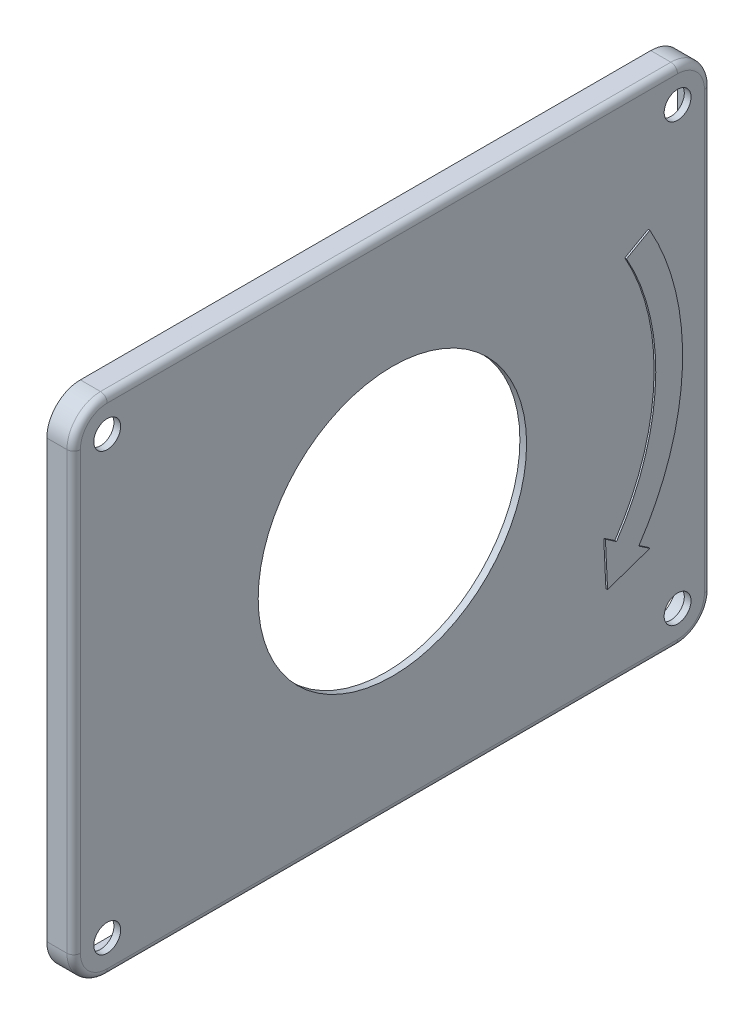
ISO-10303-21;
HEADER;
FILE_DESCRIPTION(('STEP AP214'),'2;1');
FILE_NAME('part.step','',(''),(''),'','','');
FILE_SCHEMA(('AUTOMOTIVE_DESIGN { 1 0 10303 214 1 1 1 1 }'));
ENDSEC;
DATA;
#1=APPLICATION_CONTEXT('core data for automotive mechanical design processes');
#2=APPLICATION_PROTOCOL_DEFINITION('international standard','automotive_design',2000,#1);
#3=PRODUCT_CONTEXT('',#1,'mechanical');
#4=PRODUCT('Part','Part','',(#3));
#5=PRODUCT_RELATED_PRODUCT_CATEGORY('part','',(#4));
#6=PRODUCT_DEFINITION_FORMATION('','',#4);
#7=PRODUCT_DEFINITION_CONTEXT('part definition',#1,'design');
#8=PRODUCT_DEFINITION('design','',#6,#7);
#9=PRODUCT_DEFINITION_SHAPE('','',#8);
#10=(LENGTH_UNIT() NAMED_UNIT(*) SI_UNIT(.MILLI.,.METRE.));
#11=(NAMED_UNIT(*) PLANE_ANGLE_UNIT() SI_UNIT($,.RADIAN.));
#12=(NAMED_UNIT(*) SI_UNIT($,.STERADIAN.) SOLID_ANGLE_UNIT());
#13=UNCERTAINTY_MEASURE_WITH_UNIT(LENGTH_MEASURE(1.E-05),#10,'distance_accuracy_value','');
#14=(GEOMETRIC_REPRESENTATION_CONTEXT(3) GLOBAL_UNCERTAINTY_ASSIGNED_CONTEXT((#13)) GLOBAL_UNIT_ASSIGNED_CONTEXT((#10,
#11,#12)) REPRESENTATION_CONTEXT('',''));
#15=CARTESIAN_POINT('',(0.,0.,0.));
#16=DIRECTION('',(0.,0.,1.));
#17=DIRECTION('',(1.,0.,0.));
#18=AXIS2_PLACEMENT_3D('',#15,#16,#17);
#19=CARTESIAN_POINT('',(2.,-32.5,42.5));
#20=DIRECTION('',(1.,0.,0.));
#21=DIRECTION('',(0.,0.,1.));
#22=AXIS2_PLACEMENT_3D('',#19,#20,#21);
#23=PLANE('',#22);
#24=DIRECTION('',(0.,1.,0.));
#25=VECTOR('',#24,1.);
#26=CARTESIAN_POINT('',(2.,32.5,46.5));
#27=LINE('',#26,#25);
#28=CARTESIAN_POINT('',(2.,-32.5,46.5));
#29=VERTEX_POINT('',#28);
#30=CARTESIAN_POINT('',(2.,32.5,46.5));
#31=VERTEX_POINT('',#30);
#32=EDGE_CURVE('E419',#29,#31,#27,.T.);
#33=ORIENTED_EDGE('',*,*,#32,.F.);
#34=CARTESIAN_POINT('',(2.,-32.5,42.5));
#35=DIRECTION('',(-1.,0.,0.));
#36=DIRECTION('',(0.,0.,1.));
#37=AXIS2_PLACEMENT_3D('',#34,#35,#36);
#38=CIRCLE('',#37,3.99999999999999);
#39=CARTESIAN_POINT('',(2.,-36.5,42.5));
#40=VERTEX_POINT('',#39);
#41=EDGE_CURVE('E416',#40,#29,#38,.T.);
#42=ORIENTED_EDGE('',*,*,#41,.F.);
#43=DIRECTION('',(0.,0.,1.));
#44=VECTOR('',#43,1.);
#45=CARTESIAN_POINT('',(2.,-36.5,42.5));
#46=LINE('',#45,#44);
#47=CARTESIAN_POINT('',(2.,-36.5,-42.5));
#48=VERTEX_POINT('',#47);
#49=EDGE_CURVE('E413',#48,#40,#46,.T.);
#50=ORIENTED_EDGE('',*,*,#49,.F.);
#51=CARTESIAN_POINT('',(2.,-32.5,-42.5));
#52=DIRECTION('',(-1.,0.,0.));
#53=DIRECTION('',(0.,0.,1.));
#54=AXIS2_PLACEMENT_3D('',#51,#52,#53);
#55=CIRCLE('',#54,4.);
#56=CARTESIAN_POINT('',(2.,-32.5,-46.5));
#57=VERTEX_POINT('',#56);
#58=EDGE_CURVE('E410',#57,#48,#55,.T.);
#59=ORIENTED_EDGE('',*,*,#58,.F.);
#60=DIRECTION('',(0.,-1.,0.));
#61=VECTOR('',#60,1.);
#62=CARTESIAN_POINT('',(2.,-32.5,-46.5));
#63=LINE('',#62,#61);
#64=CARTESIAN_POINT('',(2.,32.5,-46.5));
#65=VERTEX_POINT('',#64);
#66=EDGE_CURVE('E407',#65,#57,#63,.T.);
#67=ORIENTED_EDGE('',*,*,#66,.F.);
#68=CARTESIAN_POINT('',(2.,32.5,-42.5));
#69=DIRECTION('',(-1.,0.,0.));
#70=DIRECTION('',(0.,0.,1.));
#71=AXIS2_PLACEMENT_3D('',#68,#69,#70);
#72=CIRCLE('',#71,4.);
#73=CARTESIAN_POINT('',(2.,36.5,-42.5));
#74=VERTEX_POINT('',#73);
#75=EDGE_CURVE('E404',#74,#65,#72,.T.);
#76=ORIENTED_EDGE('',*,*,#75,.F.);
#77=DIRECTION('',(0.,0.,-1.));
#78=VECTOR('',#77,1.);
#79=CARTESIAN_POINT('',(2.,36.5,-42.5));
#80=LINE('',#79,#78);
#81=CARTESIAN_POINT('',(2.,36.5,42.5));
#82=VERTEX_POINT('',#81);
#83=EDGE_CURVE('E401',#82,#74,#80,.T.);
#84=ORIENTED_EDGE('',*,*,#83,.F.);
#85=CARTESIAN_POINT('',(2.,32.5,42.5));
#86=DIRECTION('',(-1.,0.,0.));
#87=DIRECTION('',(0.,0.,1.));
#88=AXIS2_PLACEMENT_3D('',#85,#86,#87);
#89=CIRCLE('',#88,4.);
#90=EDGE_CURVE('E422',#31,#82,#89,.T.);
#91=ORIENTED_EDGE('',*,*,#90,.F.);
#92=EDGE_LOOP('',(#33,#42,#50,#59,#67,#76,#84,#91));
#93=FACE_BOUND('',#92,.T.);
#94=CARTESIAN_POINT('',(2.,32.5,42.5));
#95=DIRECTION('',(-1.,0.,0.));
#96=DIRECTION('',(0.,0.,1.));
#97=AXIS2_PLACEMENT_3D('',#94,#95,#96);
#98=CIRCLE('',#97,2.);
#99=CARTESIAN_POINT('',(2.,32.5,44.5));
#100=VERTEX_POINT('',#99);
#101=EDGE_CURVE('E348',#100,#100,#98,.T.);
#102=ORIENTED_EDGE('',*,*,#101,.T.);
#103=EDGE_LOOP('',(#102));
#104=FACE_BOUND('',#103,.T.);
#105=CARTESIAN_POINT('',(2.,-32.5,-42.5));
#106=DIRECTION('',(-1.,0.,0.));
#107=DIRECTION('',(0.,0.,1.));
#108=AXIS2_PLACEMENT_3D('',#105,#106,#107);
#109=CIRCLE('',#108,2.);
#110=CARTESIAN_POINT('',(2.,-32.5,-40.5));
#111=VERTEX_POINT('',#110);
#112=EDGE_CURVE('E355',#111,#111,#109,.T.);
#113=ORIENTED_EDGE('',*,*,#112,.T.);
#114=EDGE_LOOP('',(#113));
#115=FACE_BOUND('',#114,.T.);
#116=CARTESIAN_POINT('',(2.,32.5,-42.5));
#117=DIRECTION('',(-1.,0.,0.));
#118=DIRECTION('',(0.,0.,1.));
#119=AXIS2_PLACEMENT_3D('',#116,#117,#118);
#120=CIRCLE('',#119,2.);
#121=CARTESIAN_POINT('',(2.,32.5,-40.5));
#122=VERTEX_POINT('',#121);
#123=EDGE_CURVE('E358',#122,#122,#120,.T.);
#124=ORIENTED_EDGE('',*,*,#123,.T.);
#125=EDGE_LOOP('',(#124));
#126=FACE_BOUND('',#125,.T.);
#127=CARTESIAN_POINT('',(2.,-32.5,42.5));
#128=DIRECTION('',(-1.,0.,0.));
#129=DIRECTION('',(0.,0.,1.));
#130=AXIS2_PLACEMENT_3D('',#127,#128,#129);
#131=CIRCLE('',#130,2.);
#132=CARTESIAN_POINT('',(2.,-32.5,44.5));
#133=VERTEX_POINT('',#132);
#134=EDGE_CURVE('E352',#133,#133,#131,.T.);
#135=ORIENTED_EDGE('',*,*,#134,.T.);
#136=EDGE_LOOP('',(#135));
#137=FACE_BOUND('',#136,.T.);
#138=CARTESIAN_POINT('',(2.,0.,0.));
#139=DIRECTION('',(-1.,0.,0.));
#140=DIRECTION('',(0.,0.,1.));
#141=AXIS2_PLACEMENT_3D('',#138,#139,#140);
#142=CIRCLE('',#141,20.);
#143=CARTESIAN_POINT('',(2.,0.,20.));
#144=VERTEX_POINT('',#143);
#145=EDGE_CURVE('E345',#144,#144,#142,.T.);
#146=ORIENTED_EDGE('',*,*,#145,.T.);
#147=EDGE_LOOP('',(#146));
#148=FACE_BOUND('',#147,.T.);
#149=DIRECTION('',(0.,0.490258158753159,-0.871577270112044));
#150=VECTOR('',#149,1.);
#151=CARTESIAN_POINT('',(2.,16.6687773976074,-34.6336271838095));
#152=LINE('',#151,#150);
#153=CARTESIAN_POINT('',(2.,16.6687773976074,-34.6336271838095));
#154=VERTEX_POINT('',#153);
#155=CARTESIAN_POINT('',(2.,18.62981003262,-38.1199362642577));
#156=VERTEX_POINT('',#155);
#157=EDGE_CURVE('E236',#154,#156,#152,.T.);
#158=ORIENTED_EDGE('',*,*,#157,.T.);
#159=CARTESIAN_POINT('',(2.,0.,-5.));
#160=DIRECTION('',(-1.,0.,0.));
#161=DIRECTION('',(0.,0.,1.));
#162=AXIS2_PLACEMENT_3D('',#159,#160,#161);
#163=CIRCLE('',#162,38.);
#164=CARTESIAN_POINT('',(2.,-21.3077571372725,-36.4639394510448));
#165=VERTEX_POINT('',#164);
#166=EDGE_CURVE('E265',#156,#165,#163,.T.);
#167=ORIENTED_EDGE('',*,*,#166,.T.);
#168=DIRECTION('',(0.,-0.560730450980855,-0.827998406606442));
#169=VECTOR('',#168,1.);
#170=CARTESIAN_POINT('',(2.,-21.3077571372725,-36.4639394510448));
#171=LINE('',#170,#169);
#172=CARTESIAN_POINT('',(2.,-22.4292180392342,-38.1199362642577));
#173=VERTEX_POINT('',#172);
#174=EDGE_CURVE('E268',#165,#173,#171,.T.);
#175=ORIENTED_EDGE('',*,*,#174,.T.);
#176=DIRECTION('',(0.,-0.325666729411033,0.945484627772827));
#177=VECTOR('',#176,1.);
#178=CARTESIAN_POINT('',(2.,-22.4292180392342,-38.1199362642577));
#179=LINE('',#178,#177);
#180=CARTESIAN_POINT('',(2.,-24.5994306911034,-31.8193150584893));
#181=VERTEX_POINT('',#180);
#182=EDGE_CURVE('E271',#173,#181,#179,.T.);
#183=ORIENTED_EDGE('',*,*,#182,.T.);
#184=DIRECTION('',(0.,0.99882196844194,0.0485249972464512));
#185=VECTOR('',#184,1.);
#186=CARTESIAN_POINT('',(2.,-17.9433744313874,-31.4959490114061));
#187=LINE('',#186,#185);
#188=CARTESIAN_POINT('',(2.,-17.9433744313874,-31.4959490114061));
#189=VERTEX_POINT('',#188);
#190=EDGE_CURVE('E248',#181,#189,#187,.T.);
#191=ORIENTED_EDGE('',*,*,#190,.T.);
#192=DIRECTION('',(0.,-0.560730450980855,-0.827998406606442));
#193=VECTOR('',#192,1.);
#194=CARTESIAN_POINT('',(2.,-19.0648353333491,-33.151945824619));
#195=LINE('',#194,#193);
#196=CARTESIAN_POINT('',(2.,-19.0648353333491,-33.151945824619));
#197=VERTEX_POINT('',#196);
#198=EDGE_CURVE('E245',#189,#197,#195,.T.);
#199=ORIENTED_EDGE('',*,*,#198,.T.);
#200=CARTESIAN_POINT('',(2.,0.,-5.));
#201=DIRECTION('',(1.,0.,0.));
#202=DIRECTION('',(0.,0.,1.));
#203=AXIS2_PLACEMENT_3D('',#200,#201,#202);
#204=CIRCLE('',#203,34.);
#205=EDGE_CURVE('E262',#197,#154,#204,.T.);
#206=ORIENTED_EDGE('',*,*,#205,.T.);
#207=EDGE_LOOP('',(#158,#167,#175,#183,#191,#199,#206));
#208=FACE_BOUND('',#207,.T.);
#209=ADVANCED_FACE('F39',(#93,#104,#115,#126,#137,#148,#208),#23,.T.);
#210=CARTESIAN_POINT('',(1.,-32.5,42.5));
#211=DIRECTION('',(1.,0.,0.));
#212=DIRECTION('',(0.,0.,1.));
#213=AXIS2_PLACEMENT_3D('',#210,#211,#212);
#214=PLANE('',#213);
#215=CARTESIAN_POINT('',(1.,-32.5,42.5));
#216=DIRECTION('',(-1.,0.,0.));
#217=DIRECTION('',(0.,0.,1.));
#218=AXIS2_PLACEMENT_3D('',#215,#216,#217);
#219=CIRCLE('',#218,2.);
#220=CARTESIAN_POINT('',(1.,-32.5,44.5));
#221=VERTEX_POINT('',#220);
#222=EDGE_CURVE('E47',#221,#221,#219,.T.);
#223=ORIENTED_EDGE('',*,*,#222,.F.);
#224=EDGE_LOOP('',(#223));
#225=FACE_BOUND('',#224,.T.);
#226=CARTESIAN_POINT('',(1.,32.5,-42.5));
#227=DIRECTION('',(-1.,0.,0.));
#228=DIRECTION('',(0.,0.,1.));
#229=AXIS2_PLACEMENT_3D('',#226,#227,#228);
#230=CIRCLE('',#229,2.);
#231=CARTESIAN_POINT('',(1.,32.5,-40.5));
#232=VERTEX_POINT('',#231);
#233=EDGE_CURVE('E466',#232,#232,#230,.T.);
#234=ORIENTED_EDGE('',*,*,#233,.F.);
#235=EDGE_LOOP('',(#234));
#236=FACE_BOUND('',#235,.T.);
#237=DIRECTION('',(0.,-1.,0.));
#238=VECTOR('',#237,1.);
#239=CARTESIAN_POINT('',(1.,-32.5,46.5));
#240=LINE('',#239,#238);
#241=CARTESIAN_POINT('',(1.,32.5,46.5));
#242=VERTEX_POINT('',#241);
#243=CARTESIAN_POINT('',(1.,-32.5,46.5));
#244=VERTEX_POINT('',#243);
#245=EDGE_CURVE('E285',#242,#244,#240,.T.);
#246=ORIENTED_EDGE('',*,*,#245,.F.);
#247=CARTESIAN_POINT('',(1.,32.5,42.5));
#248=DIRECTION('',(-1.,0.,0.));
#249=DIRECTION('',(0.,0.,1.));
#250=AXIS2_PLACEMENT_3D('',#247,#248,#249);
#251=CIRCLE('',#250,4.);
#252=CARTESIAN_POINT('',(1.,36.5,42.5));
#253=VERTEX_POINT('',#252);
#254=EDGE_CURVE('E289',#253,#242,#251,.F.);
#255=ORIENTED_EDGE('',*,*,#254,.F.);
#256=DIRECTION('',(0.,0.,-1.));
#257=VECTOR('',#256,1.);
#258=CARTESIAN_POINT('',(1.,36.5,-42.5));
#259=LINE('',#258,#257);
#260=CARTESIAN_POINT('',(1.,36.5,-42.5));
#261=VERTEX_POINT('',#260);
#262=EDGE_CURVE('E292',#253,#261,#259,.T.);
#263=ORIENTED_EDGE('',*,*,#262,.T.);
#264=CARTESIAN_POINT('',(1.,32.5,-42.5));
#265=DIRECTION('',(-1.,0.,0.));
#266=DIRECTION('',(0.,0.,1.));
#267=AXIS2_PLACEMENT_3D('',#264,#265,#266);
#268=CIRCLE('',#267,4.);
#269=CARTESIAN_POINT('',(1.,32.5,-46.5));
#270=VERTEX_POINT('',#269);
#271=EDGE_CURVE('E295',#261,#270,#268,.T.);
#272=ORIENTED_EDGE('',*,*,#271,.T.);
#273=DIRECTION('',(0.,-1.,0.));
#274=VECTOR('',#273,1.);
#275=CARTESIAN_POINT('',(1.,32.5,-46.5));
#276=LINE('',#275,#274);
#277=CARTESIAN_POINT('',(1.,-32.5,-46.5));
#278=VERTEX_POINT('',#277);
#279=EDGE_CURVE('E291',#270,#278,#276,.T.);
#280=ORIENTED_EDGE('',*,*,#279,.T.);
#281=CARTESIAN_POINT('',(1.,-32.5,-42.5));
#282=DIRECTION('',(-1.,0.,0.));
#283=DIRECTION('',(0.,0.,1.));
#284=AXIS2_PLACEMENT_3D('',#281,#282,#283);
#285=CIRCLE('',#284,4.);
#286=CARTESIAN_POINT('',(1.,-36.5,-42.5));
#287=VERTEX_POINT('',#286);
#288=EDGE_CURVE('E301',#287,#278,#285,.F.);
#289=ORIENTED_EDGE('',*,*,#288,.F.);
#290=DIRECTION('',(0.,0.,-1.));
#291=VECTOR('',#290,1.);
#292=CARTESIAN_POINT('',(1.,-36.5,42.5));
#293=LINE('',#292,#291);
#294=CARTESIAN_POINT('',(1.,-36.5,42.5));
#295=VERTEX_POINT('',#294);
#296=EDGE_CURVE('E305',#295,#287,#293,.T.);
#297=ORIENTED_EDGE('',*,*,#296,.F.);
#298=CARTESIAN_POINT('',(1.,-32.5,42.5));
#299=DIRECTION('',(-1.,0.,0.));
#300=DIRECTION('',(0.,0.,1.));
#301=AXIS2_PLACEMENT_3D('',#298,#299,#300);
#302=CIRCLE('',#301,3.99999999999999);
#303=EDGE_CURVE('E288',#244,#295,#302,.F.);
#304=ORIENTED_EDGE('',*,*,#303,.F.);
#305=EDGE_LOOP('',(#246,#255,#263,#272,#280,#289,#297,#304));
#306=FACE_BOUND('',#305,.T.);
#307=CARTESIAN_POINT('',(1.,-32.5,-42.5));
#308=DIRECTION('',(-1.,0.,0.));
#309=DIRECTION('',(0.,0.,1.));
#310=AXIS2_PLACEMENT_3D('',#307,#308,#309);
#311=CIRCLE('',#310,2.);
#312=CARTESIAN_POINT('',(1.,-32.5,-40.5));
#313=VERTEX_POINT('',#312);
#314=EDGE_CURVE('E449',#313,#313,#311,.T.);
#315=ORIENTED_EDGE('',*,*,#314,.F.);
#316=EDGE_LOOP('',(#315));
#317=FACE_BOUND('',#316,.T.);
#318=CARTESIAN_POINT('',(1.,0.,0.));
#319=DIRECTION('',(-1.,0.,0.));
#320=DIRECTION('',(0.,0.,1.));
#321=AXIS2_PLACEMENT_3D('',#318,#319,#320);
#322=CIRCLE('',#321,20.);
#323=CARTESIAN_POINT('',(1.,0.,20.));
#324=VERTEX_POINT('',#323);
#325=EDGE_CURVE('E469',#324,#324,#322,.T.);
#326=ORIENTED_EDGE('',*,*,#325,.F.);
#327=EDGE_LOOP('',(#326));
#328=FACE_BOUND('',#327,.T.);
#329=CARTESIAN_POINT('',(1.,32.5,42.5));
#330=DIRECTION('',(-1.,0.,0.));
#331=DIRECTION('',(0.,0.,1.));
#332=AXIS2_PLACEMENT_3D('',#329,#330,#331);
#333=CIRCLE('',#332,2.);
#334=CARTESIAN_POINT('',(1.,32.5,44.5));
#335=VERTEX_POINT('',#334);
#336=EDGE_CURVE('E11',#335,#335,#333,.T.);
#337=ORIENTED_EDGE('',*,*,#336,.F.);
#338=EDGE_LOOP('',(#337));
#339=FACE_BOUND('',#338,.T.);
#340=ADVANCED_FACE('F477',(#225,#236,#306,#317,#328,#339),#214,.F.);
#341=CARTESIAN_POINT('',(-2.,-32.5,42.5));
#342=DIRECTION('',(1.,0.,0.));
#343=DIRECTION('',(0.,0.,1.));
#344=AXIS2_PLACEMENT_3D('',#341,#342,#343);
#345=PLANE('',#344);
#346=DIRECTION('',(0.,0.,1.));
#347=VECTOR('',#346,1.);
#348=CARTESIAN_POINT('',(-2.,-36.5,-42.5));
#349=LINE('',#348,#347);
#350=CARTESIAN_POINT('',(-2.,-36.5,-42.5));
#351=VERTEX_POINT('',#350);
#352=CARTESIAN_POINT('',(-2.,-36.5,42.5));
#353=VERTEX_POINT('',#352);
#354=EDGE_CURVE('E314',#351,#353,#349,.T.);
#355=ORIENTED_EDGE('',*,*,#354,.F.);
#356=CARTESIAN_POINT('',(-2.,-32.5,-42.5));
#357=DIRECTION('',(-1.,0.,0.));
#358=DIRECTION('',(0.,0.,1.));
#359=AXIS2_PLACEMENT_3D('',#356,#357,#358);
#360=CIRCLE('',#359,4.);
#361=CARTESIAN_POINT('',(-2.,-32.5,-46.5));
#362=VERTEX_POINT('',#361);
#363=EDGE_CURVE('E330',#362,#351,#360,.T.);
#364=ORIENTED_EDGE('',*,*,#363,.F.);
#365=DIRECTION('',(0.,-1.,0.));
#366=VECTOR('',#365,1.);
#367=CARTESIAN_POINT('',(-2.,32.5,-46.5));
#368=LINE('',#367,#366);
#369=CARTESIAN_POINT('',(-2.,32.5,-46.5));
#370=VERTEX_POINT('',#369);
#371=EDGE_CURVE('E333',#370,#362,#368,.T.);
#372=ORIENTED_EDGE('',*,*,#371,.F.);
#373=CARTESIAN_POINT('',(-2.,32.5,-42.5));
#374=DIRECTION('',(-1.,0.,0.));
#375=DIRECTION('',(0.,0.,1.));
#376=AXIS2_PLACEMENT_3D('',#373,#374,#375);
#377=CIRCLE('',#376,4.);
#378=CARTESIAN_POINT('',(-2.,36.5,-42.5));
#379=VERTEX_POINT('',#378);
#380=EDGE_CURVE('E336',#379,#370,#377,.T.);
#381=ORIENTED_EDGE('',*,*,#380,.F.);
#382=DIRECTION('',(0.,0.,-1.));
#383=VECTOR('',#382,1.);
#384=CARTESIAN_POINT('',(-2.,36.5,-42.5));
#385=LINE('',#384,#383);
#386=CARTESIAN_POINT('',(-2.,36.5,42.5));
#387=VERTEX_POINT('',#386);
#388=EDGE_CURVE('E339',#387,#379,#385,.T.);
#389=ORIENTED_EDGE('',*,*,#388,.F.);
#390=CARTESIAN_POINT('',(-2.,32.5,42.5));
#391=DIRECTION('',(-1.,0.,0.));
#392=DIRECTION('',(0.,0.,1.));
#393=AXIS2_PLACEMENT_3D('',#390,#391,#392);
#394=CIRCLE('',#393,4.);
#395=CARTESIAN_POINT('',(-2.,32.5,46.5));
#396=VERTEX_POINT('',#395);
#397=EDGE_CURVE('E342',#396,#387,#394,.T.);
#398=ORIENTED_EDGE('',*,*,#397,.F.);
#399=DIRECTION('',(0.,1.,0.));
#400=VECTOR('',#399,1.);
#401=CARTESIAN_POINT('',(-2.,32.5,46.5));
#402=LINE('',#401,#400);
#403=CARTESIAN_POINT('',(-2.,-32.5,46.5));
#404=VERTEX_POINT('',#403);
#405=EDGE_CURVE('E327',#404,#396,#402,.T.);
#406=ORIENTED_EDGE('',*,*,#405,.F.);
#407=CARTESIAN_POINT('',(-2.,-32.5,42.5));
#408=DIRECTION('',(-1.,0.,0.));
#409=DIRECTION('',(0.,0.,1.));
#410=AXIS2_PLACEMENT_3D('',#407,#408,#409);
#411=CIRCLE('',#410,3.99999999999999);
#412=EDGE_CURVE('E240',#353,#404,#411,.T.);
#413=ORIENTED_EDGE('',*,*,#412,.F.);
#414=EDGE_LOOP('',(#355,#364,#372,#381,#389,#398,#406,#413));
#415=FACE_BOUND('',#414,.T.);
#416=CARTESIAN_POINT('',(-2.,-32.5,42.5));
#417=DIRECTION('',(-1.,0.,0.));
#418=DIRECTION('',(0.,0.,1.));
#419=AXIS2_PLACEMENT_3D('',#416,#417,#418);
#420=CIRCLE('',#419,4.99999999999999);
#421=CARTESIAN_POINT('',(-2.,-37.5,42.5));
#422=VERTEX_POINT('',#421);
#423=CARTESIAN_POINT('',(-2.,-32.5,47.5));
#424=VERTEX_POINT('',#423);
#425=EDGE_CURVE('E361',#422,#424,#420,.T.);
#426=ORIENTED_EDGE('',*,*,#425,.T.);
#427=DIRECTION('',(0.,1.,0.));
#428=VECTOR('',#427,1.);
#429=CARTESIAN_POINT('',(-2.,32.5,47.5));
#430=LINE('',#429,#428);
#431=CARTESIAN_POINT('',(-2.,32.5,47.5));
#432=VERTEX_POINT('',#431);
#433=EDGE_CURVE('E364',#424,#432,#430,.T.);
#434=ORIENTED_EDGE('',*,*,#433,.T.);
#435=CARTESIAN_POINT('',(-2.,32.5,42.5));
#436=DIRECTION('',(-1.,0.,0.));
#437=DIRECTION('',(0.,0.,-1.));
#438=AXIS2_PLACEMENT_3D('',#435,#436,#437);
#439=CIRCLE('',#438,5.);
#440=CARTESIAN_POINT('',(-2.,37.5,42.5));
#441=VERTEX_POINT('',#440);
#442=EDGE_CURVE('E367',#432,#441,#439,.T.);
#443=ORIENTED_EDGE('',*,*,#442,.T.);
#444=DIRECTION('',(0.,0.,-1.));
#445=VECTOR('',#444,1.);
#446=CARTESIAN_POINT('',(-2.,37.5,-42.5));
#447=LINE('',#446,#445);
#448=CARTESIAN_POINT('',(-2.,37.5,-42.5));
#449=VERTEX_POINT('',#448);
#450=EDGE_CURVE('E370',#441,#449,#447,.T.);
#451=ORIENTED_EDGE('',*,*,#450,.T.);
#452=CARTESIAN_POINT('',(-2.,32.5,-42.5));
#453=DIRECTION('',(-1.,0.,0.));
#454=DIRECTION('',(0.,0.,1.));
#455=AXIS2_PLACEMENT_3D('',#452,#453,#454);
#456=CIRCLE('',#455,5.);
#457=CARTESIAN_POINT('',(-2.,32.5,-47.5));
#458=VERTEX_POINT('',#457);
#459=EDGE_CURVE('E373',#449,#458,#456,.T.);
#460=ORIENTED_EDGE('',*,*,#459,.T.);
#461=DIRECTION('',(0.,-1.,0.));
#462=VECTOR('',#461,1.);
#463=CARTESIAN_POINT('',(-2.,32.5,-47.5));
#464=LINE('',#463,#462);
#465=CARTESIAN_POINT('',(-2.,-32.5,-47.5));
#466=VERTEX_POINT('',#465);
#467=EDGE_CURVE('E376',#458,#466,#464,.T.);
#468=ORIENTED_EDGE('',*,*,#467,.T.);
#469=CARTESIAN_POINT('',(-2.,-32.5,-42.5));
#470=DIRECTION('',(-1.,0.,0.));
#471=DIRECTION('',(0.,0.,1.));
#472=AXIS2_PLACEMENT_3D('',#469,#470,#471);
#473=CIRCLE('',#472,5.);
#474=CARTESIAN_POINT('',(-2.,-37.5,-42.5));
#475=VERTEX_POINT('',#474);
#476=EDGE_CURVE('E379',#466,#475,#473,.T.);
#477=ORIENTED_EDGE('',*,*,#476,.T.);
#478=DIRECTION('',(0.,0.,1.));
#479=VECTOR('',#478,1.);
#480=CARTESIAN_POINT('',(-2.,-37.5,-42.5));
#481=LINE('',#480,#479);
#482=EDGE_CURVE('E382',#475,#422,#481,.T.);
#483=ORIENTED_EDGE('',*,*,#482,.T.);
#484=EDGE_LOOP('',(#426,#434,#443,#451,#460,#468,#477,#483));
#485=FACE_BOUND('',#484,.T.);
#486=ADVANCED_FACE('F480',(#415,#485),#345,.F.);
#487=CARTESIAN_POINT('',(2.,-32.5,42.5));
#488=DIRECTION('',(-1.,0.,0.));
#489=DIRECTION('',(0.,0.,-1.));
#490=AXIS2_PLACEMENT_3D('',#487,#488,#489);
#491=CYLINDRICAL_SURFACE('',#490,4.99999999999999);
#492=DIRECTION('',(-1.,0.,0.));
#493=VECTOR('',#492,1.);
#494=CARTESIAN_POINT('',(2.,-32.5,47.5));
#495=LINE('',#494,#493);
#496=CARTESIAN_POINT('',(1.,-32.5,47.5));
#497=VERTEX_POINT('',#496);
#498=EDGE_CURVE('E399',#497,#424,#495,.T.);
#499=ORIENTED_EDGE('',*,*,#498,.T.);
#500=ORIENTED_EDGE('',*,*,#425,.F.);
#501=DIRECTION('',(-1.,0.,0.));
#502=VECTOR('',#501,1.);
#503=CARTESIAN_POINT('',(2.,-37.5,42.5));
#504=LINE('',#503,#502);
#505=CARTESIAN_POINT('',(1.,-37.5,42.5));
#506=VERTEX_POINT('',#505);
#507=EDGE_CURVE('E385',#506,#422,#504,.T.);
#508=ORIENTED_EDGE('',*,*,#507,.F.);
#509=CARTESIAN_POINT('',(1.,-32.5,42.5));
#510=DIRECTION('',(-1.,0.,0.));
#511=DIRECTION('',(0.,0.,1.));
#512=AXIS2_PLACEMENT_3D('',#509,#510,#511);
#513=CIRCLE('',#512,4.99999999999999);
#514=EDGE_CURVE('E431',#497,#506,#513,.F.);
#515=ORIENTED_EDGE('',*,*,#514,.F.);
#516=EDGE_LOOP('',(#499,#500,#508,#515));
#517=FACE_BOUND('',#516,.T.);
#518=ADVANCED_FACE('F588',(#517),#491,.T.);
#519=CARTESIAN_POINT('',(2.,32.5,47.5));
#520=DIRECTION('',(0.,0.,-1.));
#521=DIRECTION('',(1.,0.,0.));
#522=AXIS2_PLACEMENT_3D('',#519,#520,#521);
#523=PLANE('',#522);
#524=DIRECTION('',(-1.,0.,0.));
#525=VECTOR('',#524,1.);
#526=CARTESIAN_POINT('',(2.,32.5,47.5));
#527=LINE('',#526,#525);
#528=CARTESIAN_POINT('',(1.,32.5,47.5));
#529=VERTEX_POINT('',#528);
#530=EDGE_CURVE('E397',#529,#432,#527,.T.);
#531=ORIENTED_EDGE('',*,*,#530,.T.);
#532=ORIENTED_EDGE('',*,*,#433,.F.);
#533=ORIENTED_EDGE('',*,*,#498,.F.);
#534=DIRECTION('',(0.,1.,0.));
#535=VECTOR('',#534,1.);
#536=CARTESIAN_POINT('',(1.,-32.5,47.5));
#537=LINE('',#536,#535);
#538=EDGE_CURVE('E428',#529,#497,#537,.F.);
#539=ORIENTED_EDGE('',*,*,#538,.F.);
#540=EDGE_LOOP('',(#531,#532,#533,#539));
#541=FACE_BOUND('',#540,.T.);
#542=ADVANCED_FACE('F612',(#541),#523,.F.);
#543=CARTESIAN_POINT('',(2.,32.5,42.5));
#544=DIRECTION('',(-1.,0.,0.));
#545=DIRECTION('',(0.,0.,-1.));
#546=AXIS2_PLACEMENT_3D('',#543,#544,#545);
#547=CYLINDRICAL_SURFACE('',#546,5.);
#548=DIRECTION('',(-1.,0.,0.));
#549=VECTOR('',#548,1.);
#550=CARTESIAN_POINT('',(2.,37.5,42.5));
#551=LINE('',#550,#549);
#552=CARTESIAN_POINT('',(1.,37.5,42.5));
#553=VERTEX_POINT('',#552);
#554=EDGE_CURVE('E395',#553,#441,#551,.T.);
#555=ORIENTED_EDGE('',*,*,#554,.T.);
#556=ORIENTED_EDGE('',*,*,#442,.F.);
#557=ORIENTED_EDGE('',*,*,#530,.F.);
#558=CARTESIAN_POINT('',(1.,32.5,42.5));
#559=DIRECTION('',(-1.,0.,0.));
#560=DIRECTION('',(0.,0.,1.));
#561=AXIS2_PLACEMENT_3D('',#558,#559,#560);
#562=CIRCLE('',#561,5.);
#563=EDGE_CURVE('E425',#553,#529,#562,.F.);
#564=ORIENTED_EDGE('',*,*,#563,.F.);
#565=EDGE_LOOP('',(#555,#556,#557,#564));
#566=FACE_BOUND('',#565,.T.);
#567=ADVANCED_FACE('F608',(#566),#547,.T.);
#568=CARTESIAN_POINT('',(2.,37.5,-42.5));
#569=DIRECTION('',(0.,-1.,0.));
#570=DIRECTION('',(0.,0.,1.));
#571=AXIS2_PLACEMENT_3D('',#568,#569,#570);
#572=PLANE('',#571);
#573=DIRECTION('',(-1.,0.,0.));
#574=VECTOR('',#573,1.);
#575=CARTESIAN_POINT('',(2.,37.5,-42.5));
#576=LINE('',#575,#574);
#577=CARTESIAN_POINT('',(1.,37.5,-42.5));
#578=VERTEX_POINT('',#577);
#579=EDGE_CURVE('E393',#578,#449,#576,.T.);
#580=ORIENTED_EDGE('',*,*,#579,.T.);
#581=ORIENTED_EDGE('',*,*,#450,.F.);
#582=ORIENTED_EDGE('',*,*,#554,.F.);
#583=DIRECTION('',(0.,0.,-1.));
#584=VECTOR('',#583,1.);
#585=CARTESIAN_POINT('',(1.,37.5,42.5));
#586=LINE('',#585,#584);
#587=EDGE_CURVE('E446',#578,#553,#586,.F.);
#588=ORIENTED_EDGE('',*,*,#587,.F.);
#589=EDGE_LOOP('',(#580,#581,#582,#588));
#590=FACE_BOUND('',#589,.T.);
#591=ADVANCED_FACE('F604',(#590),#572,.F.);
#592=CARTESIAN_POINT('',(2.,32.5,-42.5));
#593=DIRECTION('',(-1.,0.,0.));
#594=DIRECTION('',(0.,0.,-1.));
#595=AXIS2_PLACEMENT_3D('',#592,#593,#594);
#596=CYLINDRICAL_SURFACE('',#595,5.);
#597=DIRECTION('',(-1.,0.,0.));
#598=VECTOR('',#597,1.);
#599=CARTESIAN_POINT('',(2.,32.5,-47.5));
#600=LINE('',#599,#598);
#601=CARTESIAN_POINT('',(1.,32.5,-47.5));
#602=VERTEX_POINT('',#601);
#603=EDGE_CURVE('E391',#602,#458,#600,.T.);
#604=ORIENTED_EDGE('',*,*,#603,.T.);
#605=ORIENTED_EDGE('',*,*,#459,.F.);
#606=ORIENTED_EDGE('',*,*,#579,.F.);
#607=CARTESIAN_POINT('',(1.,32.5,-42.5));
#608=DIRECTION('',(-1.,0.,0.));
#609=DIRECTION('',(0.,0.,1.));
#610=AXIS2_PLACEMENT_3D('',#607,#608,#609);
#611=CIRCLE('',#610,5.);
#612=EDGE_CURVE('E443',#602,#578,#611,.F.);
#613=ORIENTED_EDGE('',*,*,#612,.F.);
#614=EDGE_LOOP('',(#604,#605,#606,#613));
#615=FACE_BOUND('',#614,.T.);
#616=ADVANCED_FACE('F600',(#615),#596,.T.);
#617=CARTESIAN_POINT('',(2.,32.5,-47.5));
#618=DIRECTION('',(0.,0.,1.));
#619=DIRECTION('',(0.,1.,0.));
#620=AXIS2_PLACEMENT_3D('',#617,#618,#619);
#621=PLANE('',#620);
#622=DIRECTION('',(-1.,0.,0.));
#623=VECTOR('',#622,1.);
#624=CARTESIAN_POINT('',(2.,-32.5,-47.5));
#625=LINE('',#624,#623);
#626=CARTESIAN_POINT('',(1.,-32.5,-47.5));
#627=VERTEX_POINT('',#626);
#628=EDGE_CURVE('E389',#627,#466,#625,.T.);
#629=ORIENTED_EDGE('',*,*,#628,.T.);
#630=ORIENTED_EDGE('',*,*,#467,.F.);
#631=ORIENTED_EDGE('',*,*,#603,.F.);
#632=DIRECTION('',(0.,-1.,0.));
#633=VECTOR('',#632,1.);
#634=CARTESIAN_POINT('',(1.,32.5,-47.5));
#635=LINE('',#634,#633);
#636=EDGE_CURVE('E440',#627,#602,#635,.F.);
#637=ORIENTED_EDGE('',*,*,#636,.F.);
#638=EDGE_LOOP('',(#629,#630,#631,#637));
#639=FACE_BOUND('',#638,.T.);
#640=ADVANCED_FACE('F596',(#639),#621,.F.);
#641=CARTESIAN_POINT('',(2.,-32.5,-42.5));
#642=DIRECTION('',(-1.,0.,0.));
#643=DIRECTION('',(0.,0.,-1.));
#644=AXIS2_PLACEMENT_3D('',#641,#642,#643);
#645=CYLINDRICAL_SURFACE('',#644,5.);
#646=DIRECTION('',(-1.,0.,0.));
#647=VECTOR('',#646,1.);
#648=CARTESIAN_POINT('',(2.,-37.5,-42.5));
#649=LINE('',#648,#647);
#650=CARTESIAN_POINT('',(1.,-37.5,-42.5));
#651=VERTEX_POINT('',#650);
#652=EDGE_CURVE('E387',#651,#475,#649,.T.);
#653=ORIENTED_EDGE('',*,*,#652,.T.);
#654=ORIENTED_EDGE('',*,*,#476,.F.);
#655=ORIENTED_EDGE('',*,*,#628,.F.);
#656=CARTESIAN_POINT('',(1.,-32.5,-42.5));
#657=DIRECTION('',(-1.,0.,0.));
#658=DIRECTION('',(0.,0.,1.));
#659=AXIS2_PLACEMENT_3D('',#656,#657,#658);
#660=CIRCLE('',#659,5.);
#661=EDGE_CURVE('E437',#651,#627,#660,.F.);
#662=ORIENTED_EDGE('',*,*,#661,.F.);
#663=EDGE_LOOP('',(#653,#654,#655,#662));
#664=FACE_BOUND('',#663,.T.);
#665=ADVANCED_FACE('F592',(#664),#645,.T.);
#666=CARTESIAN_POINT('',(2.,-37.5,-42.5));
#667=DIRECTION('',(0.,1.,0.));
#668=DIRECTION('',(0.,0.,-1.));
#669=AXIS2_PLACEMENT_3D('',#666,#667,#668);
#670=PLANE('',#669);
#671=ORIENTED_EDGE('',*,*,#507,.T.);
#672=ORIENTED_EDGE('',*,*,#482,.F.);
#673=ORIENTED_EDGE('',*,*,#652,.F.);
#674=DIRECTION('',(0.,0.,1.));
#675=VECTOR('',#674,1.);
#676=CARTESIAN_POINT('',(1.,-37.5,-42.5));
#677=LINE('',#676,#675);
#678=EDGE_CURVE('E434',#506,#651,#677,.F.);
#679=ORIENTED_EDGE('',*,*,#678,.F.);
#680=EDGE_LOOP('',(#671,#672,#673,#679));
#681=FACE_BOUND('',#680,.T.);
#682=ADVANCED_FACE('F583',(#681),#670,.F.);
#683=CARTESIAN_POINT('',(2.,32.5,-42.5));
#684=DIRECTION('',(-1.,0.,0.));
#685=DIRECTION('',(0.,0.,-1.));
#686=AXIS2_PLACEMENT_3D('',#683,#684,#685);
#687=CYLINDRICAL_SURFACE('',#686,2.);
#688=ORIENTED_EDGE('',*,*,#233,.T.);
#689=EDGE_LOOP('',(#688));
#690=FACE_BOUND('',#689,.T.);
#691=ORIENTED_EDGE('',*,*,#123,.F.);
#692=EDGE_LOOP('',(#691));
#693=FACE_BOUND('',#692,.T.);
#694=ADVANCED_FACE('F580',(#690,#693),#687,.F.);
#695=CARTESIAN_POINT('',(2.,-32.5,-42.5));
#696=DIRECTION('',(-1.,0.,0.));
#697=DIRECTION('',(0.,0.,-1.));
#698=AXIS2_PLACEMENT_3D('',#695,#696,#697);
#699=CYLINDRICAL_SURFACE('',#698,2.);
#700=ORIENTED_EDGE('',*,*,#314,.T.);
#701=EDGE_LOOP('',(#700));
#702=FACE_BOUND('',#701,.T.);
#703=ORIENTED_EDGE('',*,*,#112,.F.);
#704=EDGE_LOOP('',(#703));
#705=FACE_BOUND('',#704,.T.);
#706=ADVANCED_FACE('F577',(#702,#705),#699,.F.);
#707=CARTESIAN_POINT('',(2.,-32.5,42.5));
#708=DIRECTION('',(-1.,0.,0.));
#709=DIRECTION('',(0.,0.,-1.));
#710=AXIS2_PLACEMENT_3D('',#707,#708,#709);
#711=CYLINDRICAL_SURFACE('',#710,2.);
#712=ORIENTED_EDGE('',*,*,#222,.T.);
#713=EDGE_LOOP('',(#712));
#714=FACE_BOUND('',#713,.T.);
#715=ORIENTED_EDGE('',*,*,#134,.F.);
#716=EDGE_LOOP('',(#715));
#717=FACE_BOUND('',#716,.T.);
#718=ADVANCED_FACE('F474',(#714,#717),#711,.F.);
#719=CARTESIAN_POINT('',(2.,32.5,42.5));
#720=DIRECTION('',(-1.,0.,0.));
#721=DIRECTION('',(0.,0.,-1.));
#722=AXIS2_PLACEMENT_3D('',#719,#720,#721);
#723=CYLINDRICAL_SURFACE('',#722,2.);
#724=ORIENTED_EDGE('',*,*,#336,.T.);
#725=EDGE_LOOP('',(#724));
#726=FACE_BOUND('',#725,.T.);
#727=ORIENTED_EDGE('',*,*,#101,.F.);
#728=EDGE_LOOP('',(#727));
#729=FACE_BOUND('',#728,.T.);
#730=ADVANCED_FACE('F494',(#726,#729),#723,.F.);
#731=CARTESIAN_POINT('',(2.,0.,0.));
#732=DIRECTION('',(-1.,0.,0.));
#733=DIRECTION('',(0.,0.,-1.));
#734=AXIS2_PLACEMENT_3D('',#731,#732,#733);
#735=CYLINDRICAL_SURFACE('',#734,20.);
#736=ORIENTED_EDGE('',*,*,#325,.T.);
#737=EDGE_LOOP('',(#736));
#738=FACE_BOUND('',#737,.T.);
#739=ORIENTED_EDGE('',*,*,#145,.F.);
#740=EDGE_LOOP('',(#739));
#741=FACE_BOUND('',#740,.T.);
#742=ADVANCED_FACE('F497',(#738,#741),#735,.F.);
#743=CARTESIAN_POINT('',(1.,-32.5,-42.5));
#744=DIRECTION('',(1.,0.,0.));
#745=DIRECTION('',(0.,0.,1.));
#746=AXIS2_PLACEMENT_3D('',#743,#744,#745);
#747=TOROIDAL_SURFACE('',#746,4.,1.);
#748=CARTESIAN_POINT('',(1.,-32.5,-46.5));
#749=DIRECTION('',(0.,-1.,0.));
#750=DIRECTION('',(0.,0.,-1.));
#751=AXIS2_PLACEMENT_3D('',#748,#749,#750);
#752=CIRCLE('',#751,1.);
#753=EDGE_CURVE('E461',#627,#57,#752,.T.);
#754=ORIENTED_EDGE('',*,*,#753,.T.);
#755=ORIENTED_EDGE('',*,*,#58,.T.);
#756=CARTESIAN_POINT('',(1.,-36.5,-42.5));
#757=DIRECTION('',(0.,0.,-1.));
#758=DIRECTION('',(-1.,0.,0.));
#759=AXIS2_PLACEMENT_3D('',#756,#757,#758);
#760=CIRCLE('',#759,1.);
#761=EDGE_CURVE('E349',#48,#651,#760,.T.);
#762=ORIENTED_EDGE('',*,*,#761,.T.);
#763=ORIENTED_EDGE('',*,*,#661,.T.);
#764=EDGE_LOOP('',(#754,#755,#762,#763));
#765=FACE_BOUND('',#764,.T.);
#766=ADVANCED_FACE('F41',(#765),#747,.T.);
#767=CARTESIAN_POINT('',(1.,-36.5,42.5));
#768=DIRECTION('',(0.,0.,-1.));
#769=DIRECTION('',(1.,0.,0.));
#770=AXIS2_PLACEMENT_3D('',#767,#768,#769);
#771=CYLINDRICAL_SURFACE('',#770,1.);
#772=ORIENTED_EDGE('',*,*,#761,.F.);
#773=ORIENTED_EDGE('',*,*,#49,.T.);
#774=CARTESIAN_POINT('',(1.,-36.5,42.5));
#775=DIRECTION('',(0.,0.,-1.));
#776=DIRECTION('',(-1.,0.,0.));
#777=AXIS2_PLACEMENT_3D('',#774,#775,#776);
#778=CIRCLE('',#777,1.);
#779=EDGE_CURVE('E459',#40,#506,#778,.T.);
#780=ORIENTED_EDGE('',*,*,#779,.T.);
#781=ORIENTED_EDGE('',*,*,#678,.T.);
#782=EDGE_LOOP('',(#772,#773,#780,#781));
#783=FACE_BOUND('',#782,.T.);
#784=ADVANCED_FACE('F641',(#783),#771,.T.);
#785=CARTESIAN_POINT('',(1.,-32.5,-46.5));
#786=DIRECTION('',(0.,1.,0.));
#787=DIRECTION('',(0.,0.,-1.));
#788=AXIS2_PLACEMENT_3D('',#785,#786,#787);
#789=CYLINDRICAL_SURFACE('',#788,1.);
#790=ORIENTED_EDGE('',*,*,#753,.F.);
#791=ORIENTED_EDGE('',*,*,#636,.T.);
#792=CARTESIAN_POINT('',(1.,32.5,-46.5));
#793=DIRECTION('',(0.,-1.,0.));
#794=DIRECTION('',(0.,0.,-1.));
#795=AXIS2_PLACEMENT_3D('',#792,#793,#794);
#796=CIRCLE('',#795,1.);
#797=EDGE_CURVE('E457',#602,#65,#796,.T.);
#798=ORIENTED_EDGE('',*,*,#797,.T.);
#799=ORIENTED_EDGE('',*,*,#66,.T.);
#800=EDGE_LOOP('',(#790,#791,#798,#799));
#801=FACE_BOUND('',#800,.T.);
#802=ADVANCED_FACE('F638',(#801),#789,.T.);
#803=CARTESIAN_POINT('',(1.,-32.5,42.5));
#804=DIRECTION('',(1.,0.,0.));
#805=DIRECTION('',(0.,0.,1.));
#806=AXIS2_PLACEMENT_3D('',#803,#804,#805);
#807=TOROIDAL_SURFACE('',#806,3.99999999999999,1.);
#808=ORIENTED_EDGE('',*,*,#779,.F.);
#809=ORIENTED_EDGE('',*,*,#41,.T.);
#810=CARTESIAN_POINT('',(1.,-32.5,46.5));
#811=DIRECTION('',(0.,-1.,0.));
#812=DIRECTION('',(0.,0.,-1.));
#813=AXIS2_PLACEMENT_3D('',#810,#811,#812);
#814=CIRCLE('',#813,1.);
#815=EDGE_CURVE('E455',#29,#497,#814,.T.);
#816=ORIENTED_EDGE('',*,*,#815,.T.);
#817=ORIENTED_EDGE('',*,*,#514,.T.);
#818=EDGE_LOOP('',(#808,#809,#816,#817));
#819=FACE_BOUND('',#818,.T.);
#820=ADVANCED_FACE('F634',(#819),#807,.T.);
#821=CARTESIAN_POINT('',(1.,32.5,-42.5));
#822=DIRECTION('',(1.,0.,0.));
#823=DIRECTION('',(0.,0.,1.));
#824=AXIS2_PLACEMENT_3D('',#821,#822,#823);
#825=TOROIDAL_SURFACE('',#824,4.,1.);
#826=ORIENTED_EDGE('',*,*,#797,.F.);
#827=ORIENTED_EDGE('',*,*,#612,.T.);
#828=CARTESIAN_POINT('',(1.,36.5,-42.5));
#829=DIRECTION('',(0.,0.,-1.));
#830=DIRECTION('',(-1.,0.,0.));
#831=AXIS2_PLACEMENT_3D('',#828,#829,#830);
#832=CIRCLE('',#831,1.);
#833=EDGE_CURVE('E453',#578,#74,#832,.T.);
#834=ORIENTED_EDGE('',*,*,#833,.T.);
#835=ORIENTED_EDGE('',*,*,#75,.T.);
#836=EDGE_LOOP('',(#826,#827,#834,#835));
#837=FACE_BOUND('',#836,.T.);
#838=ADVANCED_FACE('F630',(#837),#825,.T.);
#839=CARTESIAN_POINT('',(1.,-32.5,46.5));
#840=DIRECTION('',(0.,-1.,0.));
#841=DIRECTION('',(0.,0.,1.));
#842=AXIS2_PLACEMENT_3D('',#839,#840,#841);
#843=CYLINDRICAL_SURFACE('',#842,1.);
#844=ORIENTED_EDGE('',*,*,#815,.F.);
#845=ORIENTED_EDGE('',*,*,#32,.T.);
#846=CARTESIAN_POINT('',(1.,32.5,46.5));
#847=DIRECTION('',(0.,-1.,0.));
#848=DIRECTION('',(0.,0.,-1.));
#849=AXIS2_PLACEMENT_3D('',#846,#847,#848);
#850=CIRCLE('',#849,1.);
#851=EDGE_CURVE('E451',#31,#529,#850,.T.);
#852=ORIENTED_EDGE('',*,*,#851,.T.);
#853=ORIENTED_EDGE('',*,*,#538,.T.);
#854=EDGE_LOOP('',(#844,#845,#852,#853));
#855=FACE_BOUND('',#854,.T.);
#856=ADVANCED_FACE('F626',(#855),#843,.T.);
#857=CARTESIAN_POINT('',(1.,36.5,42.5));
#858=DIRECTION('',(0.,0.,1.));
#859=DIRECTION('',(-1.,0.,0.));
#860=AXIS2_PLACEMENT_3D('',#857,#858,#859);
#861=CYLINDRICAL_SURFACE('',#860,1.);
#862=ORIENTED_EDGE('',*,*,#833,.F.);
#863=ORIENTED_EDGE('',*,*,#587,.T.);
#864=CARTESIAN_POINT('',(1.,36.5,42.5));
#865=DIRECTION('',(0.,0.,-1.));
#866=DIRECTION('',(-1.,0.,0.));
#867=AXIS2_PLACEMENT_3D('',#864,#865,#866);
#868=CIRCLE('',#867,1.);
#869=EDGE_CURVE('E304',#553,#82,#868,.T.);
#870=ORIENTED_EDGE('',*,*,#869,.T.);
#871=ORIENTED_EDGE('',*,*,#83,.T.);
#872=EDGE_LOOP('',(#862,#863,#870,#871));
#873=FACE_BOUND('',#872,.T.);
#874=ADVANCED_FACE('F622',(#873),#861,.T.);
#875=CARTESIAN_POINT('',(1.,32.5,42.5));
#876=DIRECTION('',(1.,0.,0.));
#877=DIRECTION('',(0.,0.,1.));
#878=AXIS2_PLACEMENT_3D('',#875,#876,#877);
#879=TOROIDAL_SURFACE('',#878,4.,1.);
#880=ORIENTED_EDGE('',*,*,#851,.F.);
#881=ORIENTED_EDGE('',*,*,#90,.T.);
#882=ORIENTED_EDGE('',*,*,#869,.F.);
#883=ORIENTED_EDGE('',*,*,#563,.T.);
#884=EDGE_LOOP('',(#880,#881,#882,#883));
#885=FACE_BOUND('',#884,.T.);
#886=ADVANCED_FACE('F545',(#885),#879,.T.);
#887=CARTESIAN_POINT('',(2.,-32.5,42.5));
#888=DIRECTION('',(-1.,0.,0.));
#889=DIRECTION('',(0.,0.,-1.));
#890=AXIS2_PLACEMENT_3D('',#887,#888,#889);
#891=CYLINDRICAL_SURFACE('',#890,3.99999999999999);
#892=DIRECTION('',(1.,0.,0.));
#893=VECTOR('',#892,1.);
#894=CARTESIAN_POINT('',(2.,-32.5,46.5));
#895=LINE('',#894,#893);
#896=EDGE_CURVE('E296',#244,#404,#895,.F.);
#897=ORIENTED_EDGE('',*,*,#896,.F.);
#898=ORIENTED_EDGE('',*,*,#303,.T.);
#899=DIRECTION('',(-1.,0.,0.));
#900=VECTOR('',#899,1.);
#901=CARTESIAN_POINT('',(2.,-36.5,42.5));
#902=LINE('',#901,#900);
#903=EDGE_CURVE('E311',#295,#353,#902,.T.);
#904=ORIENTED_EDGE('',*,*,#903,.T.);
#905=ORIENTED_EDGE('',*,*,#412,.T.);
#906=EDGE_LOOP('',(#897,#898,#904,#905));
#907=FACE_BOUND('',#906,.T.);
#908=ADVANCED_FACE('F541',(#907),#891,.F.);
#909=CARTESIAN_POINT('',(2.,32.5,46.5));
#910=DIRECTION('',(0.,0.,-1.));
#911=DIRECTION('',(1.,0.,0.));
#912=AXIS2_PLACEMENT_3D('',#909,#910,#911);
#913=PLANE('',#912);
#914=DIRECTION('',(-1.,0.,0.));
#915=VECTOR('',#914,1.);
#916=CARTESIAN_POINT('',(2.,32.5,46.5));
#917=LINE('',#916,#915);
#918=EDGE_CURVE('E62',#242,#396,#917,.T.);
#919=ORIENTED_EDGE('',*,*,#918,.F.);
#920=ORIENTED_EDGE('',*,*,#245,.T.);
#921=ORIENTED_EDGE('',*,*,#896,.T.);
#922=ORIENTED_EDGE('',*,*,#405,.T.);
#923=EDGE_LOOP('',(#919,#920,#921,#922));
#924=FACE_BOUND('',#923,.T.);
#925=ADVANCED_FACE('F544',(#924),#913,.T.);
#926=CARTESIAN_POINT('',(2.,32.5,42.5));
#927=DIRECTION('',(-1.,0.,0.));
#928=DIRECTION('',(0.,0.,-1.));
#929=AXIS2_PLACEMENT_3D('',#926,#927,#928);
#930=CYLINDRICAL_SURFACE('',#929,4.);
#931=DIRECTION('',(1.,0.,0.));
#932=VECTOR('',#931,1.);
#933=CARTESIAN_POINT('',(2.,36.5,42.5));
#934=LINE('',#933,#932);
#935=EDGE_CURVE('E316',#253,#387,#934,.F.);
#936=ORIENTED_EDGE('',*,*,#935,.F.);
#937=ORIENTED_EDGE('',*,*,#254,.T.);
#938=ORIENTED_EDGE('',*,*,#918,.T.);
#939=ORIENTED_EDGE('',*,*,#397,.T.);
#940=EDGE_LOOP('',(#936,#937,#938,#939));
#941=FACE_BOUND('',#940,.T.);
#942=ADVANCED_FACE('F549',(#941),#930,.F.);
#943=CARTESIAN_POINT('',(2.,36.5,-42.5));
#944=DIRECTION('',(0.,-1.,0.));
#945=DIRECTION('',(0.,0.,1.));
#946=AXIS2_PLACEMENT_3D('',#943,#944,#945);
#947=PLANE('',#946);
#948=DIRECTION('',(-1.,0.,0.));
#949=VECTOR('',#948,1.);
#950=CARTESIAN_POINT('',(2.,36.5,-42.5));
#951=LINE('',#950,#949);
#952=EDGE_CURVE('E318',#261,#379,#951,.T.);
#953=ORIENTED_EDGE('',*,*,#952,.F.);
#954=ORIENTED_EDGE('',*,*,#262,.F.);
#955=ORIENTED_EDGE('',*,*,#935,.T.);
#956=ORIENTED_EDGE('',*,*,#388,.T.);
#957=EDGE_LOOP('',(#953,#954,#955,#956));
#958=FACE_BOUND('',#957,.T.);
#959=ADVANCED_FACE('F553',(#958),#947,.T.);
#960=CARTESIAN_POINT('',(2.,32.5,-42.5));
#961=DIRECTION('',(-1.,0.,0.));
#962=DIRECTION('',(0.,0.,-1.));
#963=AXIS2_PLACEMENT_3D('',#960,#961,#962);
#964=CYLINDRICAL_SURFACE('',#963,4.);
#965=DIRECTION('',(1.,0.,0.));
#966=VECTOR('',#965,1.);
#967=CARTESIAN_POINT('',(2.,32.5,-46.5));
#968=LINE('',#967,#966);
#969=EDGE_CURVE('E320',#270,#370,#968,.F.);
#970=ORIENTED_EDGE('',*,*,#969,.F.);
#971=ORIENTED_EDGE('',*,*,#271,.F.);
#972=ORIENTED_EDGE('',*,*,#952,.T.);
#973=ORIENTED_EDGE('',*,*,#380,.T.);
#974=EDGE_LOOP('',(#970,#971,#972,#973));
#975=FACE_BOUND('',#974,.T.);
#976=ADVANCED_FACE('F556',(#975),#964,.F.);
#977=CARTESIAN_POINT('',(2.,32.5,-46.5));
#978=DIRECTION('',(0.,0.,1.));
#979=DIRECTION('',(0.,1.,0.));
#980=AXIS2_PLACEMENT_3D('',#977,#978,#979);
#981=PLANE('',#980);
#982=DIRECTION('',(-1.,0.,0.));
#983=VECTOR('',#982,1.);
#984=CARTESIAN_POINT('',(2.,-32.5,-46.5));
#985=LINE('',#984,#983);
#986=EDGE_CURVE('E322',#278,#362,#985,.T.);
#987=ORIENTED_EDGE('',*,*,#986,.F.);
#988=ORIENTED_EDGE('',*,*,#279,.F.);
#989=ORIENTED_EDGE('',*,*,#969,.T.);
#990=ORIENTED_EDGE('',*,*,#371,.T.);
#991=EDGE_LOOP('',(#987,#988,#989,#990));
#992=FACE_BOUND('',#991,.T.);
#993=ADVANCED_FACE('F560',(#992),#981,.T.);
#994=CARTESIAN_POINT('',(2.,-32.5,-42.5));
#995=DIRECTION('',(-1.,0.,0.));
#996=DIRECTION('',(0.,0.,-1.));
#997=AXIS2_PLACEMENT_3D('',#994,#995,#996);
#998=CYLINDRICAL_SURFACE('',#997,4.);
#999=DIRECTION('',(1.,0.,0.));
#1000=VECTOR('',#999,1.);
#1001=CARTESIAN_POINT('',(2.,-36.5,-42.5));
#1002=LINE('',#1001,#1000);
#1003=EDGE_CURVE('E313',#287,#351,#1002,.F.);
#1004=ORIENTED_EDGE('',*,*,#1003,.F.);
#1005=ORIENTED_EDGE('',*,*,#288,.T.);
#1006=ORIENTED_EDGE('',*,*,#986,.T.);
#1007=ORIENTED_EDGE('',*,*,#363,.T.);
#1008=EDGE_LOOP('',(#1004,#1005,#1006,#1007));
#1009=FACE_BOUND('',#1008,.T.);
#1010=ADVANCED_FACE('F564',(#1009),#998,.F.);
#1011=CARTESIAN_POINT('',(2.,-36.5,-42.5));
#1012=DIRECTION('',(0.,1.,0.));
#1013=DIRECTION('',(0.,0.,-1.));
#1014=AXIS2_PLACEMENT_3D('',#1011,#1012,#1013);
#1015=PLANE('',#1014);
#1016=ORIENTED_EDGE('',*,*,#903,.F.);
#1017=ORIENTED_EDGE('',*,*,#296,.T.);
#1018=ORIENTED_EDGE('',*,*,#1003,.T.);
#1019=ORIENTED_EDGE('',*,*,#354,.T.);
#1020=EDGE_LOOP('',(#1016,#1017,#1018,#1019));
#1021=FACE_BOUND('',#1020,.T.);
#1022=ADVANCED_FACE('F539',(#1021),#1015,.T.);
#1023=CARTESIAN_POINT('',(2.25,0.,-5.));
#1024=DIRECTION('',(-1.,0.,0.));
#1025=DIRECTION('',(0.,0.,-1.));
#1026=AXIS2_PLACEMENT_3D('',#1023,#1024,#1025);
#1027=CYLINDRICAL_SURFACE('',#1026,34.);
#1028=ORIENTED_EDGE('',*,*,#205,.F.);
#1029=DIRECTION('',(-1.,0.,0.));
#1030=VECTOR('',#1029,1.);
#1031=CARTESIAN_POINT('',(2.25,-19.0648353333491,-33.151945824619));
#1032=LINE('',#1031,#1030);
#1033=CARTESIAN_POINT('',(2.25,-19.0648353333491,-33.151945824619));
#1034=VERTEX_POINT('',#1033);
#1035=EDGE_CURVE('E244',#1034,#197,#1032,.T.);
#1036=ORIENTED_EDGE('',*,*,#1035,.F.);
#1037=CARTESIAN_POINT('',(2.25,0.,-5.));
#1038=DIRECTION('',(1.,0.,0.));
#1039=DIRECTION('',(0.,0.,1.));
#1040=AXIS2_PLACEMENT_3D('',#1037,#1038,#1039);
#1041=CIRCLE('',#1040,34.);
#1042=CARTESIAN_POINT('',(2.25,16.6687773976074,-34.6336271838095));
#1043=VERTEX_POINT('',#1042);
#1044=EDGE_CURVE('E225',#1034,#1043,#1041,.T.);
#1045=ORIENTED_EDGE('',*,*,#1044,.T.);
#1046=DIRECTION('',(-1.,0.,0.));
#1047=VECTOR('',#1046,1.);
#1048=CARTESIAN_POINT('',(2.25,16.6687773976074,-34.6336271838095));
#1049=LINE('',#1048,#1047);
#1050=EDGE_CURVE('E233',#1043,#154,#1049,.T.);
#1051=ORIENTED_EDGE('',*,*,#1050,.T.);
#1052=EDGE_LOOP('',(#1028,#1036,#1045,#1051));
#1053=FACE_BOUND('',#1052,.T.);
#1054=ADVANCED_FACE('F243',(#1053),#1027,.F.);
#1055=CARTESIAN_POINT('',(2.25,16.6687773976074,-34.6336271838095));
#1056=DIRECTION('',(0.,-0.871577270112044,-0.490258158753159));
#1057=DIRECTION('',(0.,-0.490258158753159,0.871577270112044));
#1058=AXIS2_PLACEMENT_3D('',#1055,#1056,#1057);
#1059=PLANE('',#1058);
#1060=ORIENTED_EDGE('',*,*,#157,.F.);
#1061=ORIENTED_EDGE('',*,*,#1050,.F.);
#1062=DIRECTION('',(0.,0.490258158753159,-0.871577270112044));
#1063=VECTOR('',#1062,1.);
#1064=CARTESIAN_POINT('',(2.25,16.6687773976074,-34.6336271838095));
#1065=LINE('',#1064,#1063);
#1066=CARTESIAN_POINT('',(2.25,18.62981003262,-38.1199362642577));
#1067=VERTEX_POINT('',#1066);
#1068=EDGE_CURVE('E221',#1043,#1067,#1065,.T.);
#1069=ORIENTED_EDGE('',*,*,#1068,.T.);
#1070=DIRECTION('',(-1.,0.,0.));
#1071=VECTOR('',#1070,1.);
#1072=CARTESIAN_POINT('',(2.25,18.62981003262,-38.1199362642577));
#1073=LINE('',#1072,#1071);
#1074=EDGE_CURVE('E241',#1067,#156,#1073,.T.);
#1075=ORIENTED_EDGE('',*,*,#1074,.T.);
#1076=EDGE_LOOP('',(#1060,#1061,#1069,#1075));
#1077=FACE_BOUND('',#1076,.T.);
#1078=ADVANCED_FACE('F234',(#1077),#1059,.F.);
#1079=CARTESIAN_POINT('',(2.25,0.,-5.));
#1080=DIRECTION('',(-1.,0.,0.));
#1081=DIRECTION('',(0.,0.,-1.));
#1082=AXIS2_PLACEMENT_3D('',#1079,#1080,#1081);
#1083=CYLINDRICAL_SURFACE('',#1082,38.);
#1084=ORIENTED_EDGE('',*,*,#166,.F.);
#1085=ORIENTED_EDGE('',*,*,#1074,.F.);
#1086=CARTESIAN_POINT('',(2.25,0.,-5.));
#1087=DIRECTION('',(-1.,0.,0.));
#1088=DIRECTION('',(0.,0.,1.));
#1089=AXIS2_PLACEMENT_3D('',#1086,#1087,#1088);
#1090=CIRCLE('',#1089,38.);
#1091=CARTESIAN_POINT('',(2.25,-21.3077571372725,-36.4639394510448));
#1092=VERTEX_POINT('',#1091);
#1093=EDGE_CURVE('E228',#1067,#1092,#1090,.T.);
#1094=ORIENTED_EDGE('',*,*,#1093,.T.);
#1095=DIRECTION('',(-1.,0.,0.));
#1096=VECTOR('',#1095,1.);
#1097=CARTESIAN_POINT('',(2.25,-21.3077571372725,-36.4639394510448));
#1098=LINE('',#1097,#1096);
#1099=EDGE_CURVE('E282',#1092,#165,#1098,.T.);
#1100=ORIENTED_EDGE('',*,*,#1099,.T.);
#1101=EDGE_LOOP('',(#1084,#1085,#1094,#1100));
#1102=FACE_BOUND('',#1101,.T.);
#1103=ADVANCED_FACE('F527',(#1102),#1083,.T.);
#1104=CARTESIAN_POINT('',(2.25,-21.3077571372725,-36.4639394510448));
#1105=DIRECTION('',(0.,-0.827998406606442,0.560730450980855));
#1106=DIRECTION('',(0.,0.560730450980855,0.827998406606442));
#1107=AXIS2_PLACEMENT_3D('',#1104,#1105,#1106);
#1108=PLANE('',#1107);
#1109=ORIENTED_EDGE('',*,*,#174,.F.);
#1110=ORIENTED_EDGE('',*,*,#1099,.F.);
#1111=DIRECTION('',(0.,-0.560730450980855,-0.827998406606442));
#1112=VECTOR('',#1111,1.);
#1113=CARTESIAN_POINT('',(2.25,-21.3077571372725,-36.4639394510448));
#1114=LINE('',#1113,#1112);
#1115=CARTESIAN_POINT('',(2.25,-22.4292180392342,-38.1199362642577));
#1116=VERTEX_POINT('',#1115);
#1117=EDGE_CURVE('E252',#1092,#1116,#1114,.T.);
#1118=ORIENTED_EDGE('',*,*,#1117,.T.);
#1119=DIRECTION('',(-1.,0.,0.));
#1120=VECTOR('',#1119,1.);
#1121=CARTESIAN_POINT('',(2.25,-22.4292180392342,-38.1199362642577));
#1122=LINE('',#1121,#1120);
#1123=EDGE_CURVE('E280',#1116,#173,#1122,.T.);
#1124=ORIENTED_EDGE('',*,*,#1123,.T.);
#1125=EDGE_LOOP('',(#1109,#1110,#1118,#1124));
#1126=FACE_BOUND('',#1125,.T.);
#1127=ADVANCED_FACE('F525',(#1126),#1108,.F.);
#1128=CARTESIAN_POINT('',(2.25,-22.4292180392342,-38.1199362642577));
#1129=DIRECTION('',(0.,0.945484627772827,0.325666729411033));
#1130=DIRECTION('',(0.,0.325666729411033,-0.945484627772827));
#1131=AXIS2_PLACEMENT_3D('',#1128,#1129,#1130);
#1132=PLANE('',#1131);
#1133=ORIENTED_EDGE('',*,*,#182,.F.);
#1134=ORIENTED_EDGE('',*,*,#1123,.F.);
#1135=DIRECTION('',(0.,-0.325666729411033,0.945484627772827));
#1136=VECTOR('',#1135,1.);
#1137=CARTESIAN_POINT('',(2.25,-22.4292180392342,-38.1199362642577));
#1138=LINE('',#1137,#1136);
#1139=CARTESIAN_POINT('',(2.25,-24.5994306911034,-31.8193150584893));
#1140=VERTEX_POINT('',#1139);
#1141=EDGE_CURVE('E255',#1116,#1140,#1138,.T.);
#1142=ORIENTED_EDGE('',*,*,#1141,.T.);
#1143=DIRECTION('',(-1.,0.,0.));
#1144=VECTOR('',#1143,1.);
#1145=CARTESIAN_POINT('',(2.25,-24.5994306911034,-31.8193150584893));
#1146=LINE('',#1145,#1144);
#1147=EDGE_CURVE('E278',#1140,#181,#1146,.T.);
#1148=ORIENTED_EDGE('',*,*,#1147,.T.);
#1149=EDGE_LOOP('',(#1133,#1134,#1142,#1148));
#1150=FACE_BOUND('',#1149,.T.);
#1151=ADVANCED_FACE('F521',(#1150),#1132,.F.);
#1152=CARTESIAN_POINT('',(2.25,-17.9433744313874,-31.4959490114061));
#1153=DIRECTION('',(0.,0.0485249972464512,-0.99882196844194));
#1154=DIRECTION('',(0.,-0.99882196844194,-0.0485249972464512));
#1155=AXIS2_PLACEMENT_3D('',#1152,#1153,#1154);
#1156=PLANE('',#1155);
#1157=ORIENTED_EDGE('',*,*,#190,.F.);
#1158=ORIENTED_EDGE('',*,*,#1147,.F.);
#1159=DIRECTION('',(0.,0.99882196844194,0.0485249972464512));
#1160=VECTOR('',#1159,1.);
#1161=CARTESIAN_POINT('',(2.25,-17.9433744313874,-31.4959490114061));
#1162=LINE('',#1161,#1160);
#1163=CARTESIAN_POINT('',(2.25,-17.9433744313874,-31.4959490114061));
#1164=VERTEX_POINT('',#1163);
#1165=EDGE_CURVE('E258',#1140,#1164,#1162,.T.);
#1166=ORIENTED_EDGE('',*,*,#1165,.T.);
#1167=DIRECTION('',(-1.,0.,0.));
#1168=VECTOR('',#1167,1.);
#1169=CARTESIAN_POINT('',(2.25,-17.9433744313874,-31.4959490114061));
#1170=LINE('',#1169,#1168);
#1171=EDGE_CURVE('E54',#1164,#189,#1170,.T.);
#1172=ORIENTED_EDGE('',*,*,#1171,.T.);
#1173=EDGE_LOOP('',(#1157,#1158,#1166,#1172));
#1174=FACE_BOUND('',#1173,.T.);
#1175=ADVANCED_FACE('F518',(#1174),#1156,.F.);
#1176=CARTESIAN_POINT('',(2.25,-19.0648353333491,-33.151945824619));
#1177=DIRECTION('',(0.,-0.827998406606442,0.560730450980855));
#1178=DIRECTION('',(0.,0.560730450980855,0.827998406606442));
#1179=AXIS2_PLACEMENT_3D('',#1176,#1177,#1178);
#1180=PLANE('',#1179);
#1181=ORIENTED_EDGE('',*,*,#198,.F.);
#1182=ORIENTED_EDGE('',*,*,#1171,.F.);
#1183=DIRECTION('',(0.,-0.560730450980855,-0.827998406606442));
#1184=VECTOR('',#1183,1.);
#1185=CARTESIAN_POINT('',(2.25,-19.0648353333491,-33.151945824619));
#1186=LINE('',#1185,#1184);
#1187=EDGE_CURVE('E260',#1164,#1034,#1186,.T.);
#1188=ORIENTED_EDGE('',*,*,#1187,.T.);
#1189=ORIENTED_EDGE('',*,*,#1035,.T.);
#1190=EDGE_LOOP('',(#1181,#1182,#1188,#1189));
#1191=FACE_BOUND('',#1190,.T.);
#1192=ADVANCED_FACE('F515',(#1191),#1180,.F.);
#1193=CARTESIAN_POINT('',(2.25,0.,-5.));
#1194=DIRECTION('',(1.,0.,0.));
#1195=DIRECTION('',(0.,0.,1.));
#1196=AXIS2_PLACEMENT_3D('',#1193,#1194,#1195);
#1197=PLANE('',#1196);
#1198=ORIENTED_EDGE('',*,*,#1044,.F.);
#1199=ORIENTED_EDGE('',*,*,#1187,.F.);
#1200=ORIENTED_EDGE('',*,*,#1165,.F.);
#1201=ORIENTED_EDGE('',*,*,#1141,.F.);
#1202=ORIENTED_EDGE('',*,*,#1117,.F.);
#1203=ORIENTED_EDGE('',*,*,#1093,.F.);
#1204=ORIENTED_EDGE('',*,*,#1068,.F.);
#1205=EDGE_LOOP('',(#1198,#1199,#1200,#1201,#1202,#1203,#1204));
#1206=FACE_BOUND('',#1205,.T.);
#1207=ADVANCED_FACE('F223',(#1206),#1197,.T.);
#1208=CLOSED_SHELL('',(#209,#340,#486,#518,#542,#567,#591,#616,#640,#665,#682,#694,#706,#718,
#730,#742,#766,#784,#802,#820,#838,#856,#874,#886,#908,#925,#942,#959,#976,#993,#1010,#1022,
#1054,#1078,#1103,#1127,#1151,#1175,#1192,#1207));
#1209=MANIFOLD_SOLID_BREP('B2',#1208);
#1210=ADVANCED_BREP_SHAPE_REPRESENTATION('',(#18,#1209),#14);
#1211=SHAPE_DEFINITION_REPRESENTATION(#9,#1210);
ENDSEC;
END-ISO-10303-21;
